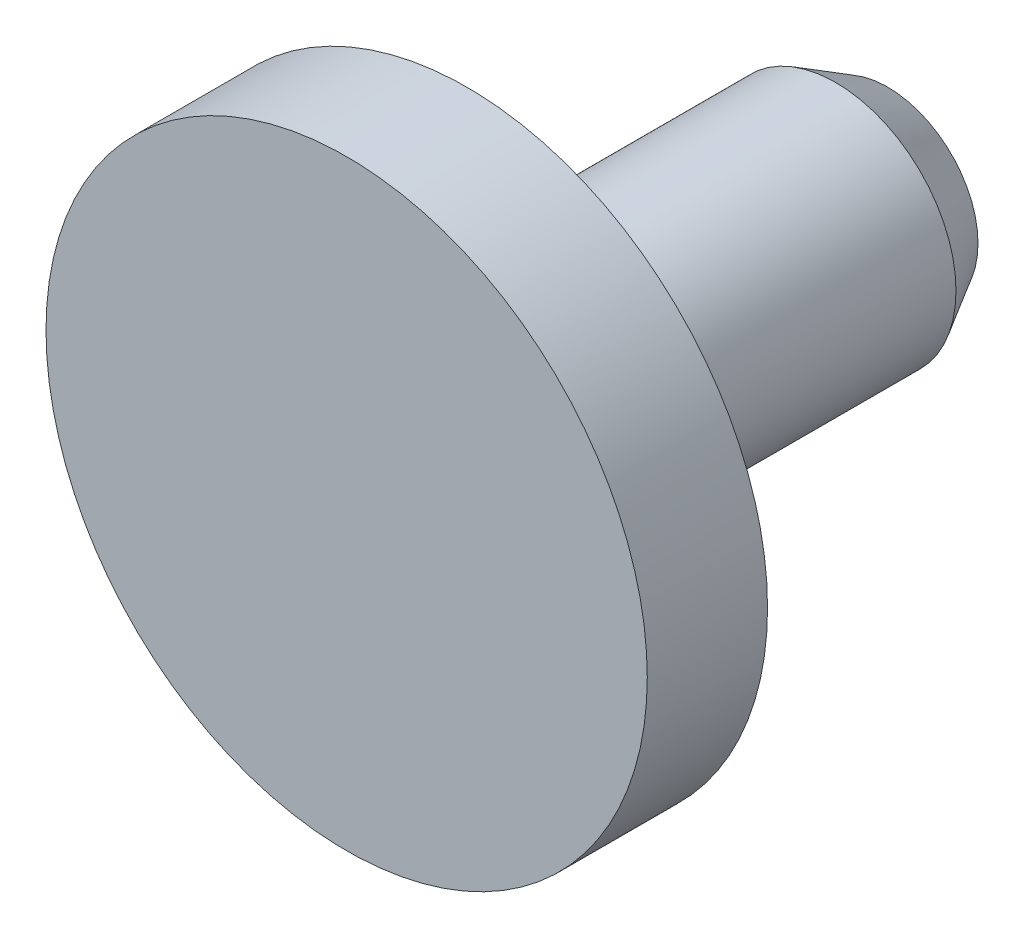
ISO-10303-21;
HEADER;
FILE_DESCRIPTION(('STEP AP214'),'2;1');
FILE_NAME('part.step','',(''),(''),'','','');
FILE_SCHEMA(('AUTOMOTIVE_DESIGN { 1 0 10303 214 1 1 1 1 }'));
ENDSEC;
DATA;
#1=APPLICATION_CONTEXT('core data for automotive mechanical design processes');
#2=APPLICATION_PROTOCOL_DEFINITION('international standard','automotive_design',2000,#1);
#3=PRODUCT_CONTEXT('',#1,'mechanical');
#4=PRODUCT('Part','Part','',(#3));
#5=PRODUCT_RELATED_PRODUCT_CATEGORY('part','',(#4));
#6=PRODUCT_DEFINITION_FORMATION('','',#4);
#7=PRODUCT_DEFINITION_CONTEXT('part definition',#1,'design');
#8=PRODUCT_DEFINITION('design','',#6,#7);
#9=PRODUCT_DEFINITION_SHAPE('','',#8);
#10=(LENGTH_UNIT() NAMED_UNIT(*) SI_UNIT(.MILLI.,.METRE.));
#11=(NAMED_UNIT(*) PLANE_ANGLE_UNIT() SI_UNIT($,.RADIAN.));
#12=(NAMED_UNIT(*) SI_UNIT($,.STERADIAN.) SOLID_ANGLE_UNIT());
#13=UNCERTAINTY_MEASURE_WITH_UNIT(LENGTH_MEASURE(1.E-05),#10,'distance_accuracy_value','');
#14=(GEOMETRIC_REPRESENTATION_CONTEXT(3) GLOBAL_UNCERTAINTY_ASSIGNED_CONTEXT((#13)) GLOBAL_UNIT_ASSIGNED_CONTEXT((#10,
#11,#12)) REPRESENTATION_CONTEXT('',''));
#15=CARTESIAN_POINT('',(0.,0.,0.));
#16=DIRECTION('',(0.,0.,1.));
#17=DIRECTION('',(1.,0.,0.));
#18=AXIS2_PLACEMENT_3D('',#15,#16,#17);
#19=CARTESIAN_POINT('',(0.,0.,2.));
#20=DIRECTION('',(0.,0.,-1.));
#21=DIRECTION('',(-1.,0.,0.));
#22=AXIS2_PLACEMENT_3D('',#19,#20,#21);
#23=CYLINDRICAL_SURFACE('',#22,5.);
#24=CARTESIAN_POINT('',(0.,0.,2.));
#25=DIRECTION('',(0.,0.,1.));
#26=DIRECTION('',(1.,0.,0.));
#27=AXIS2_PLACEMENT_3D('',#24,#25,#26);
#28=CIRCLE('',#27,5.);
#29=CARTESIAN_POINT('',(5.,0.,2.));
#30=VERTEX_POINT('',#29);
#31=EDGE_CURVE('E44',#30,#30,#28,.T.);
#32=ORIENTED_EDGE('',*,*,#31,.F.);
#33=EDGE_LOOP('',(#32));
#34=FACE_BOUND('',#33,.T.);
#35=CARTESIAN_POINT('',(0.,0.,0.));
#36=DIRECTION('',(0.,0.,1.));
#37=DIRECTION('',(1.,0.,0.));
#38=AXIS2_PLACEMENT_3D('',#35,#36,#37);
#39=CIRCLE('',#38,5.);
#40=CARTESIAN_POINT('',(5.,0.,0.));
#41=VERTEX_POINT('',#40);
#42=EDGE_CURVE('E48',#41,#41,#39,.T.);
#43=ORIENTED_EDGE('',*,*,#42,.T.);
#44=EDGE_LOOP('',(#43));
#45=FACE_BOUND('',#44,.T.);
#46=ADVANCED_FACE('F33',(#34,#45),#23,.T.);
#47=CARTESIAN_POINT('',(0.,0.,2.));
#48=DIRECTION('',(0.,0.,1.));
#49=DIRECTION('',(1.,0.,0.));
#50=AXIS2_PLACEMENT_3D('',#47,#48,#49);
#51=PLANE('',#50);
#52=ORIENTED_EDGE('',*,*,#31,.T.);
#53=EDGE_LOOP('',(#52));
#54=FACE_BOUND('',#53,.T.);
#55=ADVANCED_FACE('F69',(#54),#51,.T.);
#56=CARTESIAN_POINT('',(0.,0.,0.));
#57=DIRECTION('',(0.,0.,1.));
#58=DIRECTION('',(1.,0.,0.));
#59=AXIS2_PLACEMENT_3D('',#56,#57,#58);
#60=PLANE('',#59);
#61=CARTESIAN_POINT('',(0.,0.,0.));
#62=DIRECTION('',(0.,0.,1.));
#63=DIRECTION('',(1.,0.,0.));
#64=AXIS2_PLACEMENT_3D('',#61,#62,#63);
#65=CIRCLE('',#64,2.);
#66=CARTESIAN_POINT('',(2.,0.,0.));
#67=VERTEX_POINT('',#66);
#68=EDGE_CURVE('E52',#67,#67,#65,.T.);
#69=ORIENTED_EDGE('',*,*,#68,.T.);
#70=EDGE_LOOP('',(#69));
#71=FACE_BOUND('',#70,.T.);
#72=ORIENTED_EDGE('',*,*,#42,.F.);
#73=EDGE_LOOP('',(#72));
#74=FACE_BOUND('',#73,.T.);
#75=ADVANCED_FACE('F57',(#71,#74),#60,.F.);
#76=CARTESIAN_POINT('',(0.,0.,-7.));
#77=DIRECTION('',(0.,0.,1.));
#78=DIRECTION('',(1.,0.,0.));
#79=AXIS2_PLACEMENT_3D('',#76,#77,#78);
#80=CYLINDRICAL_SURFACE('',#79,2.);
#81=CARTESIAN_POINT('',(0.,0.,-6.13397459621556));
#82=DIRECTION('',(0.,0.,1.));
#83=DIRECTION('',(1.,0.,0.));
#84=AXIS2_PLACEMENT_3D('',#81,#82,#83);
#85=CIRCLE('',#84,2.);
#86=CARTESIAN_POINT('',(2.,0.,-6.13397459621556));
#87=VERTEX_POINT('',#86);
#88=EDGE_CURVE('E40',#87,#87,#85,.T.);
#89=ORIENTED_EDGE('',*,*,#88,.T.);
#90=EDGE_LOOP('',(#89));
#91=FACE_BOUND('',#90,.T.);
#92=ORIENTED_EDGE('',*,*,#68,.F.);
#93=EDGE_LOOP('',(#92));
#94=FACE_BOUND('',#93,.T.);
#95=ADVANCED_FACE('F60',(#91,#94),#80,.T.);
#96=CARTESIAN_POINT('',(0.,0.,-7.));
#97=DIRECTION('',(0.,0.,1.));
#98=DIRECTION('',(1.,0.,0.));
#99=AXIS2_PLACEMENT_3D('',#96,#97,#98);
#100=PLANE('',#99);
#101=CARTESIAN_POINT('',(0.,0.,-7.));
#102=DIRECTION('',(0.,0.,1.));
#103=DIRECTION('',(1.,0.,0.));
#104=AXIS2_PLACEMENT_3D('',#101,#102,#103);
#105=CIRCLE('',#104,1.5);
#106=CARTESIAN_POINT('',(1.5,0.,-7.));
#107=VERTEX_POINT('',#106);
#108=EDGE_CURVE('E10',#107,#107,#105,.F.);
#109=ORIENTED_EDGE('',*,*,#108,.T.);
#110=EDGE_LOOP('',(#109));
#111=FACE_BOUND('',#110,.T.);
#112=ADVANCED_FACE('F62',(#111),#100,.F.);
#113=CARTESIAN_POINT('',(0.,0.,-6.13397459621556));
#114=DIRECTION('',(0.,0.,1.));
#115=DIRECTION('',(1.,0.,0.));
#116=AXIS2_PLACEMENT_3D('',#113,#114,#115);
#117=CONICAL_SURFACE('',#116,2.,0.5235987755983);
#118=ORIENTED_EDGE('',*,*,#108,.F.);
#119=EDGE_LOOP('',(#118));
#120=FACE_BOUND('',#119,.T.);
#121=ORIENTED_EDGE('',*,*,#88,.F.);
#122=EDGE_LOOP('',(#121));
#123=FACE_BOUND('',#122,.T.);
#124=ADVANCED_FACE('F35',(#120,#123),#117,.T.);
#125=CLOSED_SHELL('',(#46,#55,#75,#95,#112,#124));
#126=MANIFOLD_SOLID_BREP('B2',#125);
#127=ADVANCED_BREP_SHAPE_REPRESENTATION('',(#18,#126),#14);
#128=SHAPE_DEFINITION_REPRESENTATION(#9,#127);
ENDSEC;
END-ISO-10303-21;
